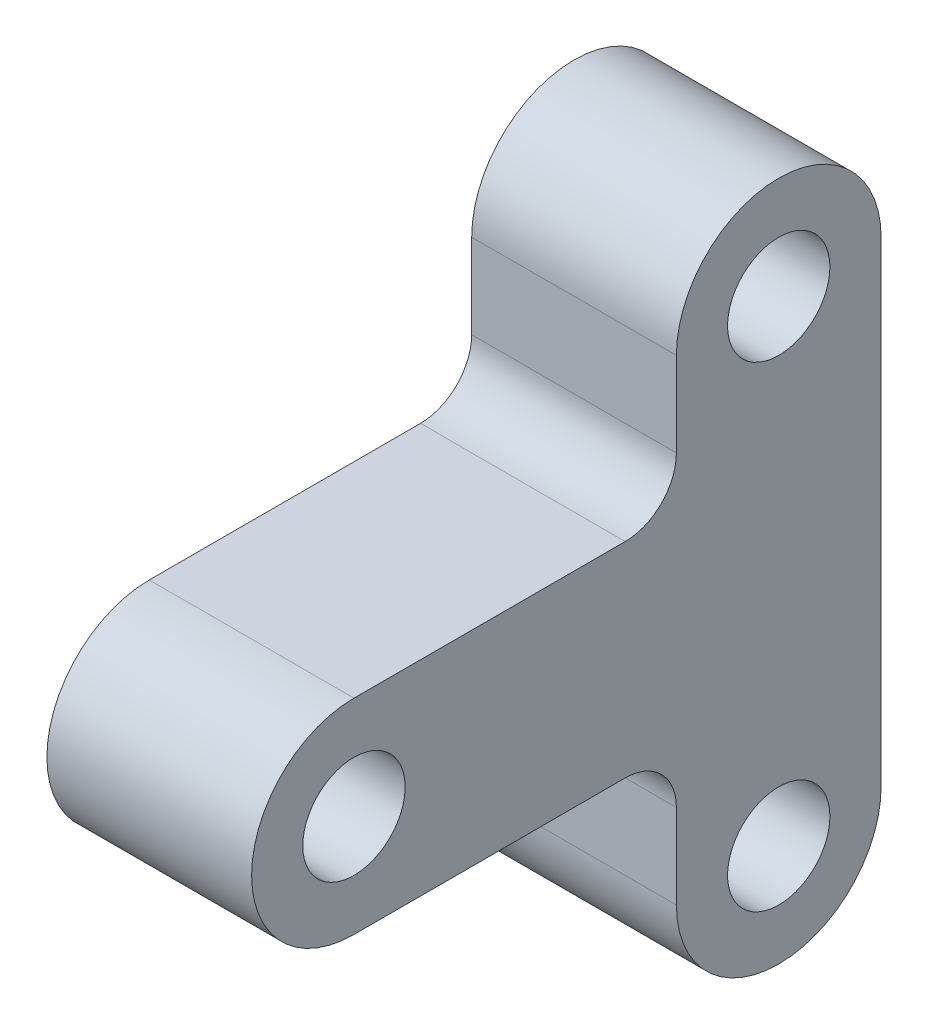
ISO-10303-21;
HEADER;
FILE_DESCRIPTION(('STEP AP214'),'2;1');
FILE_NAME('part.step','',(''),(''),'','','');
FILE_SCHEMA(('AUTOMOTIVE_DESIGN { 1 0 10303 214 1 1 1 1 }'));
ENDSEC;
DATA;
#1=APPLICATION_CONTEXT('core data for automotive mechanical design processes');
#2=APPLICATION_PROTOCOL_DEFINITION('international standard','automotive_design',2000,#1);
#3=PRODUCT_CONTEXT('',#1,'mechanical');
#4=PRODUCT('Part','Part','',(#3));
#5=PRODUCT_RELATED_PRODUCT_CATEGORY('part','',(#4));
#6=PRODUCT_DEFINITION_FORMATION('','',#4);
#7=PRODUCT_DEFINITION_CONTEXT('part definition',#1,'design');
#8=PRODUCT_DEFINITION('design','',#6,#7);
#9=PRODUCT_DEFINITION_SHAPE('','',#8);
#10=(LENGTH_UNIT() NAMED_UNIT(*) SI_UNIT(.MILLI.,.METRE.));
#11=(NAMED_UNIT(*) PLANE_ANGLE_UNIT() SI_UNIT($,.RADIAN.));
#12=(NAMED_UNIT(*) SI_UNIT($,.STERADIAN.) SOLID_ANGLE_UNIT());
#13=UNCERTAINTY_MEASURE_WITH_UNIT(LENGTH_MEASURE(1.E-05),#10,'distance_accuracy_value','');
#14=(GEOMETRIC_REPRESENTATION_CONTEXT(3) GLOBAL_UNCERTAINTY_ASSIGNED_CONTEXT((#13)) GLOBAL_UNIT_ASSIGNED_CONTEXT((#10,
#11,#12)) REPRESENTATION_CONTEXT('',''));
#15=CARTESIAN_POINT('',(0.,0.,0.));
#16=DIRECTION('',(0.,0.,1.));
#17=DIRECTION('',(1.,0.,0.));
#18=AXIS2_PLACEMENT_3D('',#15,#16,#17);
#19=CARTESIAN_POINT('',(10.,0.,0.));
#20=DIRECTION('',(-1.,0.,0.));
#21=DIRECTION('',(0.,0.,1.));
#22=AXIS2_PLACEMENT_3D('',#19,#20,#21);
#23=PLANE('',#22);
#24=CARTESIAN_POINT('',(10.,0.,0.));
#25=DIRECTION('',(1.,0.,0.));
#26=DIRECTION('',(0.,0.,-1.));
#27=AXIS2_PLACEMENT_3D('',#24,#25,#26);
#28=CIRCLE('',#27,5.);
#29=CARTESIAN_POINT('',(10.,0.,-5.));
#30=VERTEX_POINT('',#29);
#31=EDGE_CURVE('E266',#30,#30,#28,.T.);
#32=ORIENTED_EDGE('',*,*,#31,.F.);
#33=EDGE_LOOP('',(#32));
#34=FACE_BOUND('',#33,.T.);
#35=CARTESIAN_POINT('',(10.,0.,0.));
#36=DIRECTION('',(1.,0.,0.));
#37=DIRECTION('',(0.,0.,1.));
#38=AXIS2_PLACEMENT_3D('',#35,#36,#37);
#39=CIRCLE('',#38,10.);
#40=CARTESIAN_POINT('',(10.,0.,10.));
#41=VERTEX_POINT('',#40);
#42=CARTESIAN_POINT('',(10.,0.,-10.));
#43=VERTEX_POINT('',#42);
#44=EDGE_CURVE('E151',#41,#43,#39,.T.);
#45=ORIENTED_EDGE('',*,*,#44,.T.);
#46=DIRECTION('',(0.,1.,0.));
#47=VECTOR('',#46,1.);
#48=CARTESIAN_POINT('',(10.,0.,-10.));
#49=LINE('',#48,#47);
#50=CARTESIAN_POINT('',(10.,46.5,-10.));
#51=VERTEX_POINT('',#50);
#52=EDGE_CURVE('E124',#43,#51,#49,.T.);
#53=ORIENTED_EDGE('',*,*,#52,.T.);
#54=CARTESIAN_POINT('',(10.,46.5,0.));
#55=DIRECTION('',(1.,0.,0.));
#56=DIRECTION('',(0.,0.,-1.));
#57=AXIS2_PLACEMENT_3D('',#54,#55,#56);
#58=CIRCLE('',#57,10.);
#59=CARTESIAN_POINT('',(10.,46.5,10.));
#60=VERTEX_POINT('',#59);
#61=EDGE_CURVE('E154',#51,#60,#58,.T.);
#62=ORIENTED_EDGE('',*,*,#61,.T.);
#63=DIRECTION('',(0.,-1.,0.));
#64=VECTOR('',#63,1.);
#65=CARTESIAN_POINT('',(10.,38.25,10.));
#66=LINE('',#65,#64);
#67=CARTESIAN_POINT('',(10.,38.25,10.));
#68=VERTEX_POINT('',#67);
#69=EDGE_CURVE('E156',#60,#68,#66,.T.);
#70=ORIENTED_EDGE('',*,*,#69,.T.);
#71=CARTESIAN_POINT('',(10.,38.25,15.));
#72=DIRECTION('',(-1.,0.,0.));
#73=DIRECTION('',(0.,0.,-1.));
#74=AXIS2_PLACEMENT_3D('',#71,#72,#73);
#75=CIRCLE('',#74,5.);
#76=CARTESIAN_POINT('',(10.,33.25,15.));
#77=VERTEX_POINT('',#76);
#78=EDGE_CURVE('E158',#68,#77,#75,.T.);
#79=ORIENTED_EDGE('',*,*,#78,.T.);
#80=DIRECTION('',(0.,0.,1.));
#81=VECTOR('',#80,1.);
#82=CARTESIAN_POINT('',(10.,33.25,15.));
#83=LINE('',#82,#81);
#84=CARTESIAN_POINT('',(10.,33.25,41.5));
#85=VERTEX_POINT('',#84);
#86=EDGE_CURVE('E160',#77,#85,#83,.T.);
#87=ORIENTED_EDGE('',*,*,#86,.T.);
#88=CARTESIAN_POINT('',(10.,23.25,41.5));
#89=DIRECTION('',(1.,0.,0.));
#90=DIRECTION('',(0.,0.,-1.));
#91=AXIS2_PLACEMENT_3D('',#88,#89,#90);
#92=CIRCLE('',#91,10.);
#93=CARTESIAN_POINT('',(10.,13.25,41.5));
#94=VERTEX_POINT('',#93);
#95=EDGE_CURVE('E162',#85,#94,#92,.T.);
#96=ORIENTED_EDGE('',*,*,#95,.T.);
#97=DIRECTION('',(0.,0.,-1.));
#98=VECTOR('',#97,1.);
#99=CARTESIAN_POINT('',(10.,13.25,41.5));
#100=LINE('',#99,#98);
#101=CARTESIAN_POINT('',(10.,13.25,15.));
#102=VERTEX_POINT('',#101);
#103=EDGE_CURVE('E164',#94,#102,#100,.T.);
#104=ORIENTED_EDGE('',*,*,#103,.T.);
#105=CARTESIAN_POINT('',(10.,8.24999999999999,15.));
#106=DIRECTION('',(-1.,0.,0.));
#107=DIRECTION('',(0.,0.,-1.));
#108=AXIS2_PLACEMENT_3D('',#105,#106,#107);
#109=CIRCLE('',#108,5.);
#110=CARTESIAN_POINT('',(10.,8.24999999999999,9.99999999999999));
#111=VERTEX_POINT('',#110);
#112=EDGE_CURVE('E53',#102,#111,#109,.T.);
#113=ORIENTED_EDGE('',*,*,#112,.T.);
#114=DIRECTION('',(0.,-1.,0.));
#115=VECTOR('',#114,1.);
#116=CARTESIAN_POINT('',(10.,0.,10.));
#117=LINE('',#116,#115);
#118=EDGE_CURVE('E48',#111,#41,#117,.T.);
#119=ORIENTED_EDGE('',*,*,#118,.T.);
#120=EDGE_LOOP('',(#45,#53,#62,#70,#79,#87,#96,#104,#113,#119));
#121=FACE_BOUND('',#120,.T.);
#122=CARTESIAN_POINT('',(10.,46.5,0.));
#123=DIRECTION('',(1.,0.,0.));
#124=DIRECTION('',(0.,0.,-1.));
#125=AXIS2_PLACEMENT_3D('',#122,#123,#124);
#126=CIRCLE('',#125,5.00000000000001);
#127=CARTESIAN_POINT('',(10.,46.5,-5.));
#128=VERTEX_POINT('',#127);
#129=EDGE_CURVE('E129',#128,#128,#126,.T.);
#130=ORIENTED_EDGE('',*,*,#129,.F.);
#131=EDGE_LOOP('',(#130));
#132=FACE_BOUND('',#131,.T.);
#133=CARTESIAN_POINT('',(10.,23.25,41.5));
#134=DIRECTION('',(1.,0.,0.));
#135=DIRECTION('',(0.,0.,1.));
#136=AXIS2_PLACEMENT_3D('',#133,#134,#135);
#137=CIRCLE('',#136,5.);
#138=CARTESIAN_POINT('',(10.,23.25,46.5));
#139=VERTEX_POINT('',#138);
#140=EDGE_CURVE('E255',#139,#139,#137,.T.);
#141=ORIENTED_EDGE('',*,*,#140,.F.);
#142=EDGE_LOOP('',(#141));
#143=FACE_BOUND('',#142,.T.);
#144=ADVANCED_FACE('F33',(#34,#121,#132,#143),#23,.F.);
#145=CARTESIAN_POINT('',(-10.,0.,0.));
#146=DIRECTION('',(-1.,0.,0.));
#147=DIRECTION('',(0.,0.,1.));
#148=AXIS2_PLACEMENT_3D('',#145,#146,#147);
#149=PLANE('',#148);
#150=CARTESIAN_POINT('',(-10.,0.,0.));
#151=DIRECTION('',(1.,0.,0.));
#152=DIRECTION('',(0.,0.,-1.));
#153=AXIS2_PLACEMENT_3D('',#150,#151,#152);
#154=CIRCLE('',#153,5.);
#155=CARTESIAN_POINT('',(-10.,0.,-5.));
#156=VERTEX_POINT('',#155);
#157=EDGE_CURVE('E261',#156,#156,#154,.T.);
#158=ORIENTED_EDGE('',*,*,#157,.T.);
#159=EDGE_LOOP('',(#158));
#160=FACE_BOUND('',#159,.T.);
#161=CARTESIAN_POINT('',(-10.,0.,0.));
#162=DIRECTION('',(1.,0.,0.));
#163=DIRECTION('',(0.,0.,1.));
#164=AXIS2_PLACEMENT_3D('',#161,#162,#163);
#165=CIRCLE('',#164,10.);
#166=CARTESIAN_POINT('',(-10.,0.,10.));
#167=VERTEX_POINT('',#166);
#168=CARTESIAN_POINT('',(-10.,0.,-10.));
#169=VERTEX_POINT('',#168);
#170=EDGE_CURVE('E115',#167,#169,#165,.T.);
#171=ORIENTED_EDGE('',*,*,#170,.F.);
#172=DIRECTION('',(0.,-1.,0.));
#173=VECTOR('',#172,1.);
#174=CARTESIAN_POINT('',(-10.,0.,10.));
#175=LINE('',#174,#173);
#176=CARTESIAN_POINT('',(-10.,8.24999999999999,9.99999999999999));
#177=VERTEX_POINT('',#176);
#178=EDGE_CURVE('E149',#177,#167,#175,.T.);
#179=ORIENTED_EDGE('',*,*,#178,.F.);
#180=CARTESIAN_POINT('',(-10.,8.24999999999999,15.));
#181=DIRECTION('',(-1.,0.,0.));
#182=DIRECTION('',(0.,0.,-1.));
#183=AXIS2_PLACEMENT_3D('',#180,#181,#182);
#184=CIRCLE('',#183,5.);
#185=CARTESIAN_POINT('',(-10.,13.25,15.));
#186=VERTEX_POINT('',#185);
#187=EDGE_CURVE('E147',#186,#177,#184,.T.);
#188=ORIENTED_EDGE('',*,*,#187,.F.);
#189=DIRECTION('',(0.,0.,-1.));
#190=VECTOR('',#189,1.);
#191=CARTESIAN_POINT('',(-10.,13.25,41.5));
#192=LINE('',#191,#190);
#193=CARTESIAN_POINT('',(-10.,13.25,41.5));
#194=VERTEX_POINT('',#193);
#195=EDGE_CURVE('E145',#194,#186,#192,.T.);
#196=ORIENTED_EDGE('',*,*,#195,.F.);
#197=CARTESIAN_POINT('',(-10.,23.25,41.5));
#198=DIRECTION('',(1.,0.,0.));
#199=DIRECTION('',(0.,0.,-1.));
#200=AXIS2_PLACEMENT_3D('',#197,#198,#199);
#201=CIRCLE('',#200,10.);
#202=CARTESIAN_POINT('',(-10.,33.25,41.5));
#203=VERTEX_POINT('',#202);
#204=EDGE_CURVE('E143',#203,#194,#201,.T.);
#205=ORIENTED_EDGE('',*,*,#204,.F.);
#206=DIRECTION('',(0.,0.,1.));
#207=VECTOR('',#206,1.);
#208=CARTESIAN_POINT('',(-10.,33.25,15.));
#209=LINE('',#208,#207);
#210=CARTESIAN_POINT('',(-10.,33.25,15.));
#211=VERTEX_POINT('',#210);
#212=EDGE_CURVE('E141',#211,#203,#209,.T.);
#213=ORIENTED_EDGE('',*,*,#212,.F.);
#214=CARTESIAN_POINT('',(-10.,38.25,15.));
#215=DIRECTION('',(-1.,0.,0.));
#216=DIRECTION('',(0.,0.,-1.));
#217=AXIS2_PLACEMENT_3D('',#214,#215,#216);
#218=CIRCLE('',#217,5.);
#219=CARTESIAN_POINT('',(-10.,38.25,10.));
#220=VERTEX_POINT('',#219);
#221=EDGE_CURVE('E139',#220,#211,#218,.T.);
#222=ORIENTED_EDGE('',*,*,#221,.F.);
#223=DIRECTION('',(0.,-1.,0.));
#224=VECTOR('',#223,1.);
#225=CARTESIAN_POINT('',(-10.,38.25,10.));
#226=LINE('',#225,#224);
#227=CARTESIAN_POINT('',(-10.,46.5,10.));
#228=VERTEX_POINT('',#227);
#229=EDGE_CURVE('E137',#228,#220,#226,.T.);
#230=ORIENTED_EDGE('',*,*,#229,.F.);
#231=CARTESIAN_POINT('',(-10.,46.5,0.));
#232=DIRECTION('',(1.,0.,0.));
#233=DIRECTION('',(0.,0.,-1.));
#234=AXIS2_PLACEMENT_3D('',#231,#232,#233);
#235=CIRCLE('',#234,10.);
#236=CARTESIAN_POINT('',(-10.,46.5,-10.));
#237=VERTEX_POINT('',#236);
#238=EDGE_CURVE('E117',#237,#228,#235,.T.);
#239=ORIENTED_EDGE('',*,*,#238,.F.);
#240=DIRECTION('',(0.,1.,0.));
#241=VECTOR('',#240,1.);
#242=CARTESIAN_POINT('',(-10.,38.25,-10.));
#243=LINE('',#242,#241);
#244=EDGE_CURVE('E110',#169,#237,#243,.T.);
#245=ORIENTED_EDGE('',*,*,#244,.F.);
#246=EDGE_LOOP('',(#171,#179,#188,#196,#205,#213,#222,#230,#239,#245));
#247=FACE_BOUND('',#246,.T.);
#248=CARTESIAN_POINT('',(-10.,46.5,0.));
#249=DIRECTION('',(1.,0.,0.));
#250=DIRECTION('',(0.,0.,-1.));
#251=AXIS2_PLACEMENT_3D('',#248,#249,#250);
#252=CIRCLE('',#251,5.00000000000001);
#253=CARTESIAN_POINT('',(-10.,46.5,-5.));
#254=VERTEX_POINT('',#253);
#255=EDGE_CURVE('E132',#254,#254,#252,.T.);
#256=ORIENTED_EDGE('',*,*,#255,.T.);
#257=EDGE_LOOP('',(#256));
#258=FACE_BOUND('',#257,.T.);
#259=CARTESIAN_POINT('',(-10.,23.25,41.5));
#260=DIRECTION('',(1.,0.,0.));
#261=DIRECTION('',(0.,0.,1.));
#262=AXIS2_PLACEMENT_3D('',#259,#260,#261);
#263=CIRCLE('',#262,5.);
#264=CARTESIAN_POINT('',(-10.,23.25,46.5));
#265=VERTEX_POINT('',#264);
#266=EDGE_CURVE('E258',#265,#265,#263,.T.);
#267=ORIENTED_EDGE('',*,*,#266,.T.);
#268=EDGE_LOOP('',(#267));
#269=FACE_BOUND('',#268,.T.);
#270=ADVANCED_FACE('F111',(#160,#247,#258,#269),#149,.T.);
#271=CARTESIAN_POINT('',(10.,0.,0.));
#272=DIRECTION('',(-1.,0.,0.));
#273=DIRECTION('',(0.,0.,1.));
#274=AXIS2_PLACEMENT_3D('',#271,#272,#273);
#275=CYLINDRICAL_SURFACE('',#274,10.);
#276=ORIENTED_EDGE('',*,*,#170,.T.);
#277=DIRECTION('',(-1.,0.,0.));
#278=VECTOR('',#277,1.);
#279=CARTESIAN_POINT('',(10.,0.,-10.));
#280=LINE('',#279,#278);
#281=EDGE_CURVE('E11',#43,#169,#280,.T.);
#282=ORIENTED_EDGE('',*,*,#281,.F.);
#283=ORIENTED_EDGE('',*,*,#44,.F.);
#284=DIRECTION('',(-1.,0.,0.));
#285=VECTOR('',#284,1.);
#286=CARTESIAN_POINT('',(10.,0.,10.));
#287=LINE('',#286,#285);
#288=EDGE_CURVE('E128',#41,#167,#287,.T.);
#289=ORIENTED_EDGE('',*,*,#288,.T.);
#290=EDGE_LOOP('',(#276,#282,#283,#289));
#291=FACE_BOUND('',#290,.T.);
#292=ADVANCED_FACE('F35',(#291),#275,.T.);
#293=CARTESIAN_POINT('',(10.,38.25,-10.));
#294=DIRECTION('',(0.,0.,1.));
#295=DIRECTION('',(0.,-1.,0.));
#296=AXIS2_PLACEMENT_3D('',#293,#294,#295);
#297=PLANE('',#296);
#298=ORIENTED_EDGE('',*,*,#244,.T.);
#299=DIRECTION('',(-1.,0.,0.));
#300=VECTOR('',#299,1.);
#301=CARTESIAN_POINT('',(10.,46.5,-10.));
#302=LINE('',#301,#300);
#303=EDGE_CURVE('E41',#51,#237,#302,.T.);
#304=ORIENTED_EDGE('',*,*,#303,.F.);
#305=ORIENTED_EDGE('',*,*,#52,.F.);
#306=ORIENTED_EDGE('',*,*,#281,.T.);
#307=EDGE_LOOP('',(#298,#304,#305,#306));
#308=FACE_BOUND('',#307,.T.);
#309=ADVANCED_FACE('F123',(#308),#297,.F.);
#310=CARTESIAN_POINT('',(10.,46.5,0.));
#311=DIRECTION('',(-1.,0.,0.));
#312=DIRECTION('',(0.,0.,1.));
#313=AXIS2_PLACEMENT_3D('',#310,#311,#312);
#314=CYLINDRICAL_SURFACE('',#313,10.);
#315=ORIENTED_EDGE('',*,*,#238,.T.);
#316=DIRECTION('',(-1.,0.,0.));
#317=VECTOR('',#316,1.);
#318=CARTESIAN_POINT('',(10.,46.5,10.));
#319=LINE('',#318,#317);
#320=EDGE_CURVE('E187',#60,#228,#319,.T.);
#321=ORIENTED_EDGE('',*,*,#320,.F.);
#322=ORIENTED_EDGE('',*,*,#61,.F.);
#323=ORIENTED_EDGE('',*,*,#303,.T.);
#324=EDGE_LOOP('',(#315,#321,#322,#323));
#325=FACE_BOUND('',#324,.T.);
#326=ADVANCED_FACE('F191',(#325),#314,.T.);
#327=CARTESIAN_POINT('',(10.,38.25,10.));
#328=DIRECTION('',(0.,0.,-1.));
#329=DIRECTION('',(0.,1.,0.));
#330=AXIS2_PLACEMENT_3D('',#327,#328,#329);
#331=PLANE('',#330);
#332=ORIENTED_EDGE('',*,*,#229,.T.);
#333=DIRECTION('',(-1.,0.,0.));
#334=VECTOR('',#333,1.);
#335=CARTESIAN_POINT('',(10.,38.25,10.));
#336=LINE('',#335,#334);
#337=EDGE_CURVE('E184',#68,#220,#336,.T.);
#338=ORIENTED_EDGE('',*,*,#337,.F.);
#339=ORIENTED_EDGE('',*,*,#69,.F.);
#340=ORIENTED_EDGE('',*,*,#320,.T.);
#341=EDGE_LOOP('',(#332,#338,#339,#340));
#342=FACE_BOUND('',#341,.T.);
#343=ADVANCED_FACE('F199',(#342),#331,.F.);
#344=CARTESIAN_POINT('',(10.,38.25,15.));
#345=DIRECTION('',(-1.,0.,0.));
#346=DIRECTION('',(0.,0.,1.));
#347=AXIS2_PLACEMENT_3D('',#344,#345,#346);
#348=CYLINDRICAL_SURFACE('',#347,5.);
#349=ORIENTED_EDGE('',*,*,#221,.T.);
#350=DIRECTION('',(-1.,0.,0.));
#351=VECTOR('',#350,1.);
#352=CARTESIAN_POINT('',(10.,33.25,15.));
#353=LINE('',#352,#351);
#354=EDGE_CURVE('E181',#77,#211,#353,.T.);
#355=ORIENTED_EDGE('',*,*,#354,.F.);
#356=ORIENTED_EDGE('',*,*,#78,.F.);
#357=ORIENTED_EDGE('',*,*,#337,.T.);
#358=EDGE_LOOP('',(#349,#355,#356,#357));
#359=FACE_BOUND('',#358,.T.);
#360=ADVANCED_FACE('F202',(#359),#348,.F.);
#361=CARTESIAN_POINT('',(10.,33.25,15.));
#362=DIRECTION('',(0.,-1.,0.));
#363=DIRECTION('',(0.,0.,-1.));
#364=AXIS2_PLACEMENT_3D('',#361,#362,#363);
#365=PLANE('',#364);
#366=ORIENTED_EDGE('',*,*,#212,.T.);
#367=DIRECTION('',(-1.,0.,0.));
#368=VECTOR('',#367,1.);
#369=CARTESIAN_POINT('',(10.,33.25,41.5));
#370=LINE('',#369,#368);
#371=EDGE_CURVE('E178',#85,#203,#370,.T.);
#372=ORIENTED_EDGE('',*,*,#371,.F.);
#373=ORIENTED_EDGE('',*,*,#86,.F.);
#374=ORIENTED_EDGE('',*,*,#354,.T.);
#375=EDGE_LOOP('',(#366,#372,#373,#374));
#376=FACE_BOUND('',#375,.T.);
#377=ADVANCED_FACE('F207',(#376),#365,.F.);
#378=CARTESIAN_POINT('',(10.,23.25,41.5));
#379=DIRECTION('',(-1.,0.,0.));
#380=DIRECTION('',(0.,0.,1.));
#381=AXIS2_PLACEMENT_3D('',#378,#379,#380);
#382=CYLINDRICAL_SURFACE('',#381,10.);
#383=ORIENTED_EDGE('',*,*,#204,.T.);
#384=DIRECTION('',(-1.,0.,0.));
#385=VECTOR('',#384,1.);
#386=CARTESIAN_POINT('',(10.,13.25,41.5));
#387=LINE('',#386,#385);
#388=EDGE_CURVE('E175',#94,#194,#387,.T.);
#389=ORIENTED_EDGE('',*,*,#388,.F.);
#390=ORIENTED_EDGE('',*,*,#95,.F.);
#391=ORIENTED_EDGE('',*,*,#371,.T.);
#392=EDGE_LOOP('',(#383,#389,#390,#391));
#393=FACE_BOUND('',#392,.T.);
#394=ADVANCED_FACE('F213',(#393),#382,.T.);
#395=CARTESIAN_POINT('',(10.,13.25,41.5));
#396=DIRECTION('',(0.,1.,0.));
#397=DIRECTION('',(0.,0.,1.));
#398=AXIS2_PLACEMENT_3D('',#395,#396,#397);
#399=PLANE('',#398);
#400=ORIENTED_EDGE('',*,*,#195,.T.);
#401=DIRECTION('',(-1.,0.,0.));
#402=VECTOR('',#401,1.);
#403=CARTESIAN_POINT('',(10.,13.25,15.));
#404=LINE('',#403,#402);
#405=EDGE_CURVE('E172',#102,#186,#404,.T.);
#406=ORIENTED_EDGE('',*,*,#405,.F.);
#407=ORIENTED_EDGE('',*,*,#103,.F.);
#408=ORIENTED_EDGE('',*,*,#388,.T.);
#409=EDGE_LOOP('',(#400,#406,#407,#408));
#410=FACE_BOUND('',#409,.T.);
#411=ADVANCED_FACE('F217',(#410),#399,.F.);
#412=CARTESIAN_POINT('',(10.,8.24999999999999,15.));
#413=DIRECTION('',(-1.,0.,0.));
#414=DIRECTION('',(0.,0.,1.));
#415=AXIS2_PLACEMENT_3D('',#412,#413,#414);
#416=CYLINDRICAL_SURFACE('',#415,5.);
#417=ORIENTED_EDGE('',*,*,#187,.T.);
#418=DIRECTION('',(-1.,0.,0.));
#419=VECTOR('',#418,1.);
#420=CARTESIAN_POINT('',(10.,8.24999999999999,9.99999999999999));
#421=LINE('',#420,#419);
#422=EDGE_CURVE('E169',#111,#177,#421,.T.);
#423=ORIENTED_EDGE('',*,*,#422,.F.);
#424=ORIENTED_EDGE('',*,*,#112,.F.);
#425=ORIENTED_EDGE('',*,*,#405,.T.);
#426=EDGE_LOOP('',(#417,#423,#424,#425));
#427=FACE_BOUND('',#426,.T.);
#428=ADVANCED_FACE('F220',(#427),#416,.F.);
#429=CARTESIAN_POINT('',(10.,0.,10.));
#430=DIRECTION('',(0.,0.,-1.));
#431=DIRECTION('',(0.,1.,0.));
#432=AXIS2_PLACEMENT_3D('',#429,#430,#431);
#433=PLANE('',#432);
#434=ORIENTED_EDGE('',*,*,#178,.T.);
#435=ORIENTED_EDGE('',*,*,#288,.F.);
#436=ORIENTED_EDGE('',*,*,#118,.F.);
#437=ORIENTED_EDGE('',*,*,#422,.T.);
#438=EDGE_LOOP('',(#434,#435,#436,#437));
#439=FACE_BOUND('',#438,.T.);
#440=ADVANCED_FACE('F222',(#439),#433,.F.);
#441=CARTESIAN_POINT('',(10.,46.5,0.));
#442=DIRECTION('',(-1.,0.,0.));
#443=DIRECTION('',(0.,0.,1.));
#444=AXIS2_PLACEMENT_3D('',#441,#442,#443);
#445=CYLINDRICAL_SURFACE('',#444,5.00000000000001);
#446=ORIENTED_EDGE('',*,*,#129,.T.);
#447=EDGE_LOOP('',(#446));
#448=FACE_BOUND('',#447,.T.);
#449=ORIENTED_EDGE('',*,*,#255,.F.);
#450=EDGE_LOOP('',(#449));
#451=FACE_BOUND('',#450,.T.);
#452=ADVANCED_FACE('F224',(#448,#451),#445,.F.);
#453=CARTESIAN_POINT('',(10.,0.,0.));
#454=DIRECTION('',(-1.,0.,0.));
#455=DIRECTION('',(0.,0.,1.));
#456=AXIS2_PLACEMENT_3D('',#453,#454,#455);
#457=CYLINDRICAL_SURFACE('',#456,5.);
#458=ORIENTED_EDGE('',*,*,#31,.T.);
#459=EDGE_LOOP('',(#458));
#460=FACE_BOUND('',#459,.T.);
#461=ORIENTED_EDGE('',*,*,#157,.F.);
#462=EDGE_LOOP('',(#461));
#463=FACE_BOUND('',#462,.T.);
#464=ADVANCED_FACE('F230',(#460,#463),#457,.F.);
#465=CARTESIAN_POINT('',(10.,23.25,41.5));
#466=DIRECTION('',(-1.,0.,0.));
#467=DIRECTION('',(0.,0.,1.));
#468=AXIS2_PLACEMENT_3D('',#465,#466,#467);
#469=CYLINDRICAL_SURFACE('',#468,5.);
#470=ORIENTED_EDGE('',*,*,#140,.T.);
#471=EDGE_LOOP('',(#470));
#472=FACE_BOUND('',#471,.T.);
#473=ORIENTED_EDGE('',*,*,#266,.F.);
#474=EDGE_LOOP('',(#473));
#475=FACE_BOUND('',#474,.T.);
#476=ADVANCED_FACE('F246',(#472,#475),#469,.F.);
#477=CLOSED_SHELL('',(#144,#270,#292,#309,#326,#343,#360,#377,#394,#411,#428,#440,#452,#464,#476));
#478=MANIFOLD_SOLID_BREP('B2',#477);
#479=ADVANCED_BREP_SHAPE_REPRESENTATION('',(#18,#478),#14);
#480=SHAPE_DEFINITION_REPRESENTATION(#9,#479);
ENDSEC;
END-ISO-10303-21;
